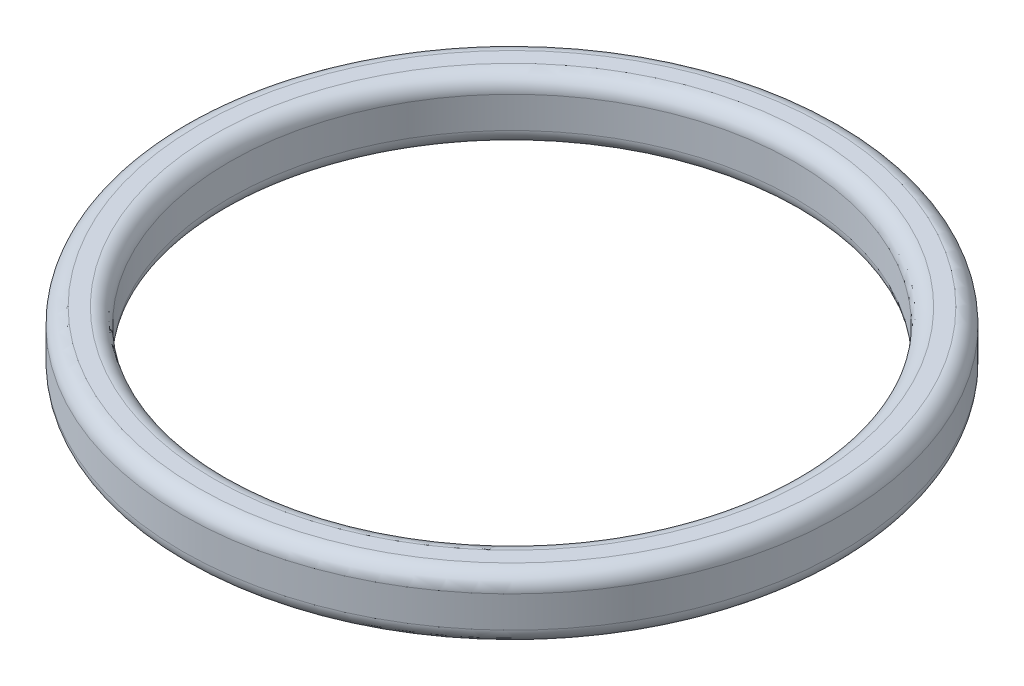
from build123d import *


with BuildPart() as part:
    # Esquisse1 → Base-R_volution (revolve)
    with BuildSketch(Plane.XY, mode=Mode.PRIVATE) as base_r_volution_sk:
        with BuildLine():
            Line((-10, 19.05), (-9.5, 19.05))
            ThreePointArc((-9.5, 19.05), (-9.146446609, 19.196446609), (-9, 19.55))
            Line((-9, 19.55), (-9, 20.55))
            ThreePointArc((-9, 20.55), (-9.146446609, 20.903553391), (-9.5, 21.05))
            Line((-9.5, 21.05), (-10, 21.05))
            ThreePointArc((-10, 21.05), (-10.353553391, 20.903553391), (-10.5, 20.55))
            Line((-10.5, 20.55), (-10.5, 19.55))
            ThreePointArc((-10.5, 19.55), (-10.353553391, 19.196446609), (-10, 19.05))
        make_face()
    revolve(base_r_volution_sk.sketch.rotate(Axis((0, 0, 0), (0, 1, 0)), 270), axis=Axis((0, 0, 0), (0, 1, 0)))


solid = part.part
